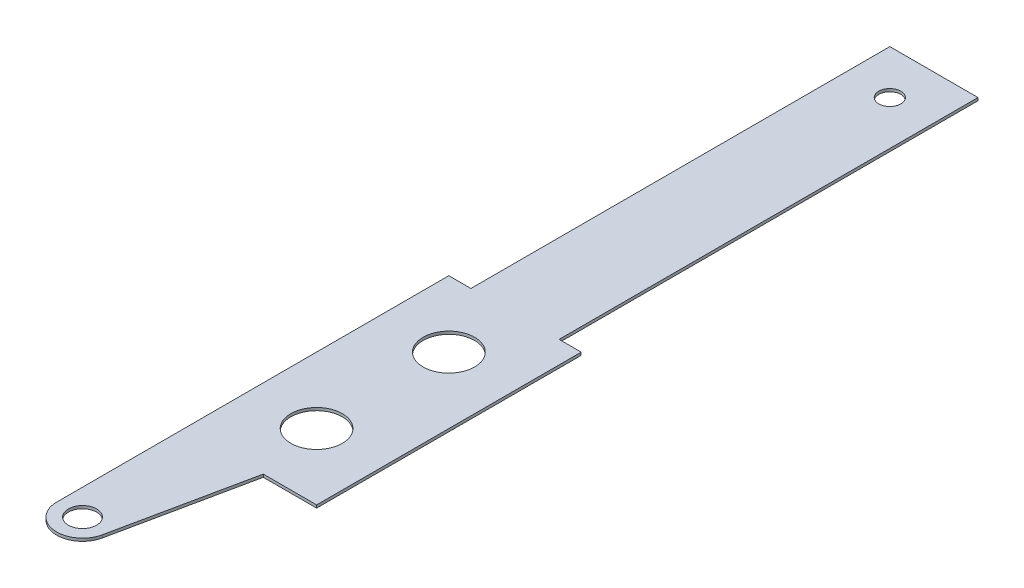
ISO-10303-21;
HEADER;
FILE_DESCRIPTION(('STEP AP214'),'2;1');
FILE_NAME('part.step','',(''),(''),'','','');
FILE_SCHEMA(('AUTOMOTIVE_DESIGN { 1 0 10303 214 1 1 1 1 }'));
ENDSEC;
DATA;
#1=APPLICATION_CONTEXT('core data for automotive mechanical design processes');
#2=APPLICATION_PROTOCOL_DEFINITION('international standard','automotive_design',2000,#1);
#3=PRODUCT_CONTEXT('',#1,'mechanical');
#4=PRODUCT('Part','Part','',(#3));
#5=PRODUCT_RELATED_PRODUCT_CATEGORY('part','',(#4));
#6=PRODUCT_DEFINITION_FORMATION('','',#4);
#7=PRODUCT_DEFINITION_CONTEXT('part definition',#1,'design');
#8=PRODUCT_DEFINITION('design','',#6,#7);
#9=PRODUCT_DEFINITION_SHAPE('','',#8);
#10=(LENGTH_UNIT() NAMED_UNIT(*) SI_UNIT(.MILLI.,.METRE.));
#11=(NAMED_UNIT(*) PLANE_ANGLE_UNIT() SI_UNIT($,.RADIAN.));
#12=(NAMED_UNIT(*) SI_UNIT($,.STERADIAN.) SOLID_ANGLE_UNIT());
#13=UNCERTAINTY_MEASURE_WITH_UNIT(LENGTH_MEASURE(1.E-05),#10,'distance_accuracy_value','');
#14=(GEOMETRIC_REPRESENTATION_CONTEXT(3) GLOBAL_UNCERTAINTY_ASSIGNED_CONTEXT((#13)) GLOBAL_UNIT_ASSIGNED_CONTEXT((#10,
#11,#12)) REPRESENTATION_CONTEXT('',''));
#15=CARTESIAN_POINT('',(0.,0.,0.));
#16=DIRECTION('',(0.,0.,1.));
#17=DIRECTION('',(1.,0.,0.));
#18=AXIS2_PLACEMENT_3D('',#15,#16,#17);
#19=CARTESIAN_POINT('',(-4.76631,-0.2032,9.525));
#20=DIRECTION('',(0.,0.,1.));
#21=DIRECTION('',(1.,0.,0.));
#22=AXIS2_PLACEMENT_3D('',#19,#20,#21);
#23=PLANE('',#22);
#24=DIRECTION('',(1.,0.,0.));
#25=VECTOR('',#24,1.);
#26=CARTESIAN_POINT('',(-4.76631,0.,9.525));
#27=LINE('',#26,#25);
#28=CARTESIAN_POINT('',(0.923290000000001,0.,9.525));
#29=VERTEX_POINT('',#28);
#30=CARTESIAN_POINT('',(4.76631,0.,9.525));
#31=VERTEX_POINT('',#30);
#32=EDGE_CURVE('E129',#29,#31,#27,.T.);
#33=ORIENTED_EDGE('',*,*,#32,.F.);
#34=DIRECTION('',(0.,-1.,0.));
#35=VECTOR('',#34,1.);
#36=CARTESIAN_POINT('',(0.923290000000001,0.,9.525));
#37=LINE('',#36,#35);
#38=CARTESIAN_POINT('',(0.923289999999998,-0.2032,9.525));
#39=VERTEX_POINT('',#38);
#40=EDGE_CURVE('E114',#29,#39,#37,.T.);
#41=ORIENTED_EDGE('',*,*,#40,.T.);
#42=DIRECTION('',(1.,0.,0.));
#43=VECTOR('',#42,1.);
#44=CARTESIAN_POINT('',(-4.76631,-0.2032,9.525));
#45=LINE('',#44,#43);
#46=CARTESIAN_POINT('',(4.76631,-0.2032,9.525));
#47=VERTEX_POINT('',#46);
#48=EDGE_CURVE('E147',#39,#47,#45,.T.);
#49=ORIENTED_EDGE('',*,*,#48,.T.);
#50=DIRECTION('',(0.,1.,0.));
#51=VECTOR('',#50,1.);
#52=CARTESIAN_POINT('',(4.76631,-0.2032,9.525));
#53=LINE('',#52,#51);
#54=EDGE_CURVE('E11',#47,#31,#53,.T.);
#55=ORIENTED_EDGE('',*,*,#54,.T.);
#56=EDGE_LOOP('',(#33,#41,#49,#55));
#57=FACE_BOUND('',#56,.T.);
#58=ADVANCED_FACE('F37',(#57),#23,.T.);
#59=CARTESIAN_POINT('',(-4.76631,-0.2032,-9.525));
#60=DIRECTION('',(0.,0.,-1.));
#61=DIRECTION('',(-1.,0.,0.));
#62=AXIS2_PLACEMENT_3D('',#59,#60,#61);
#63=PLANE('',#62);
#64=DIRECTION('',(-1.,0.,0.));
#65=VECTOR('',#64,1.);
#66=CARTESIAN_POINT('',(-4.76631,-0.2032,-9.525));
#67=LINE('',#66,#65);
#68=CARTESIAN_POINT('',(4.76631,-0.2032,-9.525));
#69=VERTEX_POINT('',#68);
#70=CARTESIAN_POINT('',(3.175,-0.2032,-9.525));
#71=VERTEX_POINT('',#70);
#72=EDGE_CURVE('E170',#69,#71,#67,.T.);
#73=ORIENTED_EDGE('',*,*,#72,.T.);
#74=DIRECTION('',(0.,1.,0.));
#75=VECTOR('',#74,1.);
#76=CARTESIAN_POINT('',(3.175,-0.2032,-9.525));
#77=LINE('',#76,#75);
#78=CARTESIAN_POINT('',(3.17499999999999,0.,-9.525));
#79=VERTEX_POINT('',#78);
#80=EDGE_CURVE('E232',#71,#79,#77,.T.);
#81=ORIENTED_EDGE('',*,*,#80,.T.);
#82=DIRECTION('',(-1.,0.,0.));
#83=VECTOR('',#82,1.);
#84=CARTESIAN_POINT('',(-4.76631,0.,-9.525));
#85=LINE('',#84,#83);
#86=CARTESIAN_POINT('',(4.76631,0.,-9.525));
#87=VERTEX_POINT('',#86);
#88=EDGE_CURVE('E140',#87,#79,#85,.T.);
#89=ORIENTED_EDGE('',*,*,#88,.F.);
#90=DIRECTION('',(0.,1.,0.));
#91=VECTOR('',#90,1.);
#92=CARTESIAN_POINT('',(4.76631,-0.2032,-9.525));
#93=LINE('',#92,#91);
#94=EDGE_CURVE('E155',#69,#87,#93,.T.);
#95=ORIENTED_EDGE('',*,*,#94,.F.);
#96=EDGE_LOOP('',(#73,#81,#89,#95));
#97=FACE_BOUND('',#96,.T.);
#98=ADVANCED_FACE('F285',(#97),#63,.T.);
#99=CARTESIAN_POINT('',(4.76631,-0.2032,9.525));
#100=DIRECTION('',(1.,0.,0.));
#101=DIRECTION('',(0.,0.,-1.));
#102=AXIS2_PLACEMENT_3D('',#99,#100,#101);
#103=PLANE('',#102);
#104=DIRECTION('',(0.,0.,-1.));
#105=VECTOR('',#104,1.);
#106=CARTESIAN_POINT('',(4.76631,0.,9.525));
#107=LINE('',#106,#105);
#108=EDGE_CURVE('E163',#31,#87,#107,.T.);
#109=ORIENTED_EDGE('',*,*,#108,.F.);
#110=ORIENTED_EDGE('',*,*,#54,.F.);
#111=DIRECTION('',(0.,0.,-1.));
#112=VECTOR('',#111,1.);
#113=CARTESIAN_POINT('',(4.76631,-0.2032,9.525));
#114=LINE('',#113,#112);
#115=EDGE_CURVE('E134',#47,#69,#114,.T.);
#116=ORIENTED_EDGE('',*,*,#115,.T.);
#117=ORIENTED_EDGE('',*,*,#94,.T.);
#118=EDGE_LOOP('',(#109,#110,#116,#117));
#119=FACE_BOUND('',#118,.T.);
#120=ADVANCED_FACE('F39',(#119),#103,.T.);
#121=CARTESIAN_POINT('',(-4.76631,-0.2032,9.525));
#122=DIRECTION('',(-1.,0.,0.));
#123=DIRECTION('',(0.,0.,1.));
#124=AXIS2_PLACEMENT_3D('',#121,#122,#123);
#125=PLANE('',#124);
#126=DIRECTION('',(0.,0.,1.));
#127=VECTOR('',#126,1.);
#128=CARTESIAN_POINT('',(-4.76631,0.,9.525));
#129=LINE('',#128,#127);
#130=CARTESIAN_POINT('',(-4.76631,0.,-9.525));
#131=VERTEX_POINT('',#130);
#132=CARTESIAN_POINT('',(-4.76631,0.,18.7126917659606));
#133=VERTEX_POINT('',#132);
#134=EDGE_CURVE('E135',#131,#133,#129,.T.);
#135=ORIENTED_EDGE('',*,*,#134,.F.);
#136=DIRECTION('',(0.,1.,0.));
#137=VECTOR('',#136,1.);
#138=CARTESIAN_POINT('',(-4.76631,-0.2032,-9.525));
#139=LINE('',#138,#137);
#140=CARTESIAN_POINT('',(-4.76631,-0.2032,-9.525));
#141=VERTEX_POINT('',#140);
#142=EDGE_CURVE('E46',#141,#131,#139,.T.);
#143=ORIENTED_EDGE('',*,*,#142,.F.);
#144=DIRECTION('',(0.,0.,1.));
#145=VECTOR('',#144,1.);
#146=CARTESIAN_POINT('',(-4.76631,-0.2032,9.525));
#147=LINE('',#146,#145);
#148=CARTESIAN_POINT('',(-4.76631,-0.2032,18.7126917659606));
#149=VERTEX_POINT('',#148);
#150=EDGE_CURVE('E168',#141,#149,#147,.T.);
#151=ORIENTED_EDGE('',*,*,#150,.T.);
#152=DIRECTION('',(0.,-1.,0.));
#153=VECTOR('',#152,1.);
#154=CARTESIAN_POINT('',(-4.76631,0.,18.7126917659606));
#155=LINE('',#154,#153);
#156=EDGE_CURVE('E205',#133,#149,#155,.T.);
#157=ORIENTED_EDGE('',*,*,#156,.F.);
#158=EDGE_LOOP('',(#135,#143,#151,#157));
#159=FACE_BOUND('',#158,.T.);
#160=ADVANCED_FACE('F191',(#159),#125,.T.);
#161=DIRECTION('',(0.,1.,0.));
#162=VECTOR('',#161,1.);
#163=CARTESIAN_POINT('',(-3.175,-0.2032,-9.525));
#164=LINE('',#163,#162);
#165=CARTESIAN_POINT('',(-3.175,-0.2032,-9.525));
#166=VERTEX_POINT('',#165);
#167=CARTESIAN_POINT('',(-3.175,0.,-9.525));
#168=VERTEX_POINT('',#167);
#169=EDGE_CURVE('E186',#166,#168,#164,.T.);
#170=ORIENTED_EDGE('',*,*,#169,.F.);
#171=EDGE_CURVE('E138',#166,#141,#67,.T.);
#172=ORIENTED_EDGE('',*,*,#171,.T.);
#173=ORIENTED_EDGE('',*,*,#142,.T.);
#174=EDGE_CURVE('E159',#168,#131,#85,.T.);
#175=ORIENTED_EDGE('',*,*,#174,.F.);
#176=EDGE_LOOP('',(#170,#172,#173,#175));
#177=FACE_BOUND('',#176,.T.);
#178=ADVANCED_FACE('F183',(#177),#63,.T.);
#179=CARTESIAN_POINT('',(0.,-0.2032,0.));
#180=DIRECTION('',(0.,-1.,0.));
#181=DIRECTION('',(0.,0.,-1.));
#182=AXIS2_PLACEMENT_3D('',#179,#180,#181);
#183=PLANE('',#182);
#184=CARTESIAN_POINT('',(0.,-0.2032,-36.5125));
#185=DIRECTION('',(0.,1.,0.));
#186=DIRECTION('',(0.,0.,1.));
#187=AXIS2_PLACEMENT_3D('',#184,#185,#186);
#188=CIRCLE('',#187,0.79375);
#189=CARTESIAN_POINT('',(0.,-0.2032,-35.71875));
#190=VERTEX_POINT('',#189);
#191=EDGE_CURVE('E211',#190,#190,#188,.T.);
#192=ORIENTED_EDGE('',*,*,#191,.T.);
#193=EDGE_LOOP('',(#192));
#194=FACE_BOUND('',#193,.T.);
#195=CARTESIAN_POINT('',(0.,-0.2032,4.7625));
#196=DIRECTION('',(0.,1.,0.));
#197=DIRECTION('',(0.,0.,-1.));
#198=AXIS2_PLACEMENT_3D('',#195,#196,#197);
#199=CIRCLE('',#198,1.8542);
#200=CARTESIAN_POINT('',(0.,-0.2032,2.9083));
#201=VERTEX_POINT('',#200);
#202=EDGE_CURVE('E257',#201,#201,#199,.T.);
#203=ORIENTED_EDGE('',*,*,#202,.T.);
#204=EDGE_LOOP('',(#203));
#205=FACE_BOUND('',#204,.T.);
#206=CARTESIAN_POINT('',(0.,-0.2032,-4.7625));
#207=DIRECTION('',(0.,1.,0.));
#208=DIRECTION('',(0.,0.,1.));
#209=AXIS2_PLACEMENT_3D('',#206,#207,#208);
#210=CIRCLE('',#209,1.8542);
#211=CARTESIAN_POINT('',(0.,-0.2032,-2.9083));
#212=VERTEX_POINT('',#211);
#213=EDGE_CURVE('E165',#212,#212,#210,.T.);
#214=ORIENTED_EDGE('',*,*,#213,.T.);
#215=EDGE_LOOP('',(#214));
#216=FACE_BOUND('',#215,.T.);
#217=ORIENTED_EDGE('',*,*,#115,.F.);
#218=ORIENTED_EDGE('',*,*,#48,.F.);
#219=DIRECTION('',(-0.205220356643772,0.,0.978715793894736));
#220=VECTOR('',#219,1.);
#221=CARTESIAN_POINT('',(0.923290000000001,-0.2032,9.525));
#222=LINE('',#221,#220);
#223=CARTESIAN_POINT('',(-1.08331,-0.2032,19.0946701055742));
#224=VERTEX_POINT('',#223);
#225=EDGE_CURVE('E54',#39,#224,#222,.T.);
#226=ORIENTED_EDGE('',*,*,#225,.T.);
#227=CARTESIAN_POINT('',(-2.90500176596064,-0.2032,18.7126917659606));
#228=DIRECTION('',(0.,-1.,0.));
#229=DIRECTION('',(0.,0.,1.));
#230=AXIS2_PLACEMENT_3D('',#227,#228,#229);
#231=CIRCLE('',#230,1.86130823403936);
#232=EDGE_CURVE('E131',#224,#149,#231,.T.);
#233=ORIENTED_EDGE('',*,*,#232,.T.);
#234=ORIENTED_EDGE('',*,*,#150,.F.);
#235=ORIENTED_EDGE('',*,*,#171,.F.);
#236=DIRECTION('',(0.,0.,1.));
#237=VECTOR('',#236,1.);
#238=CARTESIAN_POINT('',(-3.175,-0.2032,-39.6875));
#239=LINE('',#238,#237);
#240=CARTESIAN_POINT('',(-3.175,-0.2032,-39.6875));
#241=VERTEX_POINT('',#240);
#242=EDGE_CURVE('E221',#241,#166,#239,.T.);
#243=ORIENTED_EDGE('',*,*,#242,.F.);
#244=DIRECTION('',(-1.,0.,0.));
#245=VECTOR('',#244,1.);
#246=CARTESIAN_POINT('',(-3.175,-0.2032,-39.6875));
#247=LINE('',#246,#245);
#248=CARTESIAN_POINT('',(3.175,-0.2032,-39.6875));
#249=VERTEX_POINT('',#248);
#250=EDGE_CURVE('E218',#249,#241,#247,.T.);
#251=ORIENTED_EDGE('',*,*,#250,.F.);
#252=DIRECTION('',(0.,0.,-1.));
#253=VECTOR('',#252,1.);
#254=CARTESIAN_POINT('',(3.175,-0.2032,-39.6875));
#255=LINE('',#254,#253);
#256=EDGE_CURVE('E222',#71,#249,#255,.T.);
#257=ORIENTED_EDGE('',*,*,#256,.F.);
#258=ORIENTED_EDGE('',*,*,#72,.F.);
#259=EDGE_LOOP('',(#217,#218,#226,#233,#234,#235,#243,#251,#257,#258));
#260=FACE_BOUND('',#259,.T.);
#261=CARTESIAN_POINT('',(-2.90500176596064,-0.2032,18.7126917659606));
#262=DIRECTION('',(0.,-1.,0.));
#263=DIRECTION('',(0.,0.,-1.));
#264=AXIS2_PLACEMENT_3D('',#261,#262,#263);
#265=CIRCLE('',#264,1.016);
#266=CARTESIAN_POINT('',(-2.90500176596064,-0.2032,17.6966917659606));
#267=VERTEX_POINT('',#266);
#268=EDGE_CURVE('E458',#267,#267,#265,.T.);
#269=ORIENTED_EDGE('',*,*,#268,.F.);
#270=EDGE_LOOP('',(#269));
#271=FACE_BOUND('',#270,.T.);
#272=ADVANCED_FACE('F196',(#194,#205,#216,#260,#271),#183,.T.);
#273=CARTESIAN_POINT('',(0.,0.,0.));
#274=DIRECTION('',(0.,-1.,0.));
#275=DIRECTION('',(0.,0.,-1.));
#276=AXIS2_PLACEMENT_3D('',#273,#274,#275);
#277=PLANE('',#276);
#278=CARTESIAN_POINT('',(0.,0.,-36.5125));
#279=DIRECTION('',(0.,1.,0.));
#280=DIRECTION('',(0.,0.,1.));
#281=AXIS2_PLACEMENT_3D('',#278,#279,#280);
#282=CIRCLE('',#281,0.79375);
#283=CARTESIAN_POINT('',(0.,0.,-35.71875));
#284=VERTEX_POINT('',#283);
#285=EDGE_CURVE('E207',#284,#284,#282,.T.);
#286=ORIENTED_EDGE('',*,*,#285,.F.);
#287=EDGE_LOOP('',(#286));
#288=FACE_BOUND('',#287,.T.);
#289=CARTESIAN_POINT('',(0.,0.,4.7625));
#290=DIRECTION('',(0.,1.,0.));
#291=DIRECTION('',(0.,0.,-1.));
#292=AXIS2_PLACEMENT_3D('',#289,#290,#291);
#293=CIRCLE('',#292,1.8542);
#294=CARTESIAN_POINT('',(0.,0.,2.9083));
#295=VERTEX_POINT('',#294);
#296=EDGE_CURVE('E235',#295,#295,#293,.T.);
#297=ORIENTED_EDGE('',*,*,#296,.F.);
#298=EDGE_LOOP('',(#297));
#299=FACE_BOUND('',#298,.T.);
#300=CARTESIAN_POINT('',(0.,0.,-4.7625));
#301=DIRECTION('',(0.,1.,0.));
#302=DIRECTION('',(0.,0.,1.));
#303=AXIS2_PLACEMENT_3D('',#300,#301,#302);
#304=CIRCLE('',#303,1.8542);
#305=CARTESIAN_POINT('',(0.,0.,-2.9083));
#306=VERTEX_POINT('',#305);
#307=EDGE_CURVE('E260',#306,#306,#304,.T.);
#308=ORIENTED_EDGE('',*,*,#307,.F.);
#309=EDGE_LOOP('',(#308));
#310=FACE_BOUND('',#309,.T.);
#311=ORIENTED_EDGE('',*,*,#108,.T.);
#312=ORIENTED_EDGE('',*,*,#88,.T.);
#313=DIRECTION('',(0.,0.,-1.));
#314=VECTOR('',#313,1.);
#315=CARTESIAN_POINT('',(3.175,0.,-39.6875));
#316=LINE('',#315,#314);
#317=CARTESIAN_POINT('',(3.175,0.,-39.6875));
#318=VERTEX_POINT('',#317);
#319=EDGE_CURVE('E62',#79,#318,#316,.T.);
#320=ORIENTED_EDGE('',*,*,#319,.T.);
#321=DIRECTION('',(-1.,0.,0.));
#322=VECTOR('',#321,1.);
#323=CARTESIAN_POINT('',(-3.175,0.,-39.6875));
#324=LINE('',#323,#322);
#325=CARTESIAN_POINT('',(-3.175,0.,-39.6875));
#326=VERTEX_POINT('',#325);
#327=EDGE_CURVE('E223',#318,#326,#324,.T.);
#328=ORIENTED_EDGE('',*,*,#327,.T.);
#329=DIRECTION('',(0.,0.,1.));
#330=VECTOR('',#329,1.);
#331=CARTESIAN_POINT('',(-3.175,0.,-39.6875));
#332=LINE('',#331,#330);
#333=EDGE_CURVE('E226',#326,#168,#332,.T.);
#334=ORIENTED_EDGE('',*,*,#333,.T.);
#335=ORIENTED_EDGE('',*,*,#174,.T.);
#336=ORIENTED_EDGE('',*,*,#134,.T.);
#337=CARTESIAN_POINT('',(-2.90500176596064,0.,18.7126917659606));
#338=DIRECTION('',(0.,-1.,0.));
#339=DIRECTION('',(0.,0.,1.));
#340=AXIS2_PLACEMENT_3D('',#337,#338,#339);
#341=CIRCLE('',#340,1.86130823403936);
#342=CARTESIAN_POINT('',(-1.08331,0.,19.0946701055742));
#343=VERTEX_POINT('',#342);
#344=EDGE_CURVE('E122',#343,#133,#341,.T.);
#345=ORIENTED_EDGE('',*,*,#344,.F.);
#346=DIRECTION('',(-0.205220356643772,0.,0.978715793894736));
#347=VECTOR('',#346,1.);
#348=CARTESIAN_POINT('',(0.923290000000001,0.,9.525));
#349=LINE('',#348,#347);
#350=EDGE_CURVE('E117',#29,#343,#349,.T.);
#351=ORIENTED_EDGE('',*,*,#350,.F.);
#352=ORIENTED_EDGE('',*,*,#32,.T.);
#353=EDGE_LOOP('',(#311,#312,#320,#328,#334,#335,#336,#345,#351,#352));
#354=FACE_BOUND('',#353,.T.);
#355=CARTESIAN_POINT('',(-2.90500176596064,0.,18.7126917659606));
#356=DIRECTION('',(0.,-1.,0.));
#357=DIRECTION('',(0.,0.,-1.));
#358=AXIS2_PLACEMENT_3D('',#355,#356,#357);
#359=CIRCLE('',#358,1.016);
#360=CARTESIAN_POINT('',(-2.90500176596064,0.,17.6966917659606));
#361=VERTEX_POINT('',#360);
#362=EDGE_CURVE('E201',#361,#361,#359,.T.);
#363=ORIENTED_EDGE('',*,*,#362,.T.);
#364=EDGE_LOOP('',(#363));
#365=FACE_BOUND('',#364,.T.);
#366=ADVANCED_FACE('F127',(#288,#299,#310,#354,#365),#277,.F.);
#367=CARTESIAN_POINT('',(0.,-0.2032,-4.7625));
#368=DIRECTION('',(0.,1.,0.));
#369=DIRECTION('',(0.,0.,1.));
#370=AXIS2_PLACEMENT_3D('',#367,#368,#369);
#371=CYLINDRICAL_SURFACE('',#370,1.8542);
#372=ORIENTED_EDGE('',*,*,#213,.F.);
#373=EDGE_LOOP('',(#372));
#374=FACE_BOUND('',#373,.T.);
#375=ORIENTED_EDGE('',*,*,#307,.T.);
#376=EDGE_LOOP('',(#375));
#377=FACE_BOUND('',#376,.T.);
#378=ADVANCED_FACE('F267',(#374,#377),#371,.F.);
#379=CARTESIAN_POINT('',(0.,-0.2032,4.7625));
#380=DIRECTION('',(0.,1.,0.));
#381=DIRECTION('',(0.,0.,1.));
#382=AXIS2_PLACEMENT_3D('',#379,#380,#381);
#383=CYLINDRICAL_SURFACE('',#382,1.8542);
#384=ORIENTED_EDGE('',*,*,#202,.F.);
#385=EDGE_LOOP('',(#384));
#386=FACE_BOUND('',#385,.T.);
#387=ORIENTED_EDGE('',*,*,#296,.T.);
#388=EDGE_LOOP('',(#387));
#389=FACE_BOUND('',#388,.T.);
#390=ADVANCED_FACE('F276',(#386,#389),#383,.F.);
#391=CARTESIAN_POINT('',(3.175,-0.2032,-39.6875));
#392=DIRECTION('',(1.,0.,0.));
#393=DIRECTION('',(0.,0.,-1.));
#394=AXIS2_PLACEMENT_3D('',#391,#392,#393);
#395=PLANE('',#394);
#396=ORIENTED_EDGE('',*,*,#319,.F.);
#397=ORIENTED_EDGE('',*,*,#80,.F.);
#398=ORIENTED_EDGE('',*,*,#256,.T.);
#399=DIRECTION('',(0.,1.,0.));
#400=VECTOR('',#399,1.);
#401=CARTESIAN_POINT('',(3.175,-0.2032,-39.6875));
#402=LINE('',#401,#400);
#403=EDGE_CURVE('E244',#249,#318,#402,.T.);
#404=ORIENTED_EDGE('',*,*,#403,.T.);
#405=EDGE_LOOP('',(#396,#397,#398,#404));
#406=FACE_BOUND('',#405,.T.);
#407=ADVANCED_FACE('F351',(#406),#395,.T.);
#408=CARTESIAN_POINT('',(-3.175,-0.2032,-39.6875));
#409=DIRECTION('',(-1.,0.,0.));
#410=DIRECTION('',(0.,0.,1.));
#411=AXIS2_PLACEMENT_3D('',#408,#409,#410);
#412=PLANE('',#411);
#413=ORIENTED_EDGE('',*,*,#333,.F.);
#414=DIRECTION('',(0.,1.,0.));
#415=VECTOR('',#414,1.);
#416=CARTESIAN_POINT('',(-3.175,-0.2032,-39.6875));
#417=LINE('',#416,#415);
#418=EDGE_CURVE('E242',#241,#326,#417,.T.);
#419=ORIENTED_EDGE('',*,*,#418,.F.);
#420=ORIENTED_EDGE('',*,*,#242,.T.);
#421=ORIENTED_EDGE('',*,*,#169,.T.);
#422=EDGE_LOOP('',(#413,#419,#420,#421));
#423=FACE_BOUND('',#422,.T.);
#424=ADVANCED_FACE('F250',(#423),#412,.T.);
#425=CARTESIAN_POINT('',(-3.175,-0.2032,-39.6875));
#426=DIRECTION('',(0.,0.,-1.));
#427=DIRECTION('',(-1.,0.,0.));
#428=AXIS2_PLACEMENT_3D('',#425,#426,#427);
#429=PLANE('',#428);
#430=ORIENTED_EDGE('',*,*,#327,.F.);
#431=ORIENTED_EDGE('',*,*,#403,.F.);
#432=ORIENTED_EDGE('',*,*,#250,.T.);
#433=ORIENTED_EDGE('',*,*,#418,.T.);
#434=EDGE_LOOP('',(#430,#431,#432,#433));
#435=FACE_BOUND('',#434,.T.);
#436=ADVANCED_FACE('F254',(#435),#429,.T.);
#437=CARTESIAN_POINT('',(0.,-0.2032,-36.5125));
#438=DIRECTION('',(0.,1.,0.));
#439=DIRECTION('',(0.,0.,1.));
#440=AXIS2_PLACEMENT_3D('',#437,#438,#439);
#441=CYLINDRICAL_SURFACE('',#440,0.79375);
#442=ORIENTED_EDGE('',*,*,#191,.F.);
#443=EDGE_LOOP('',(#442));
#444=FACE_BOUND('',#443,.T.);
#445=ORIENTED_EDGE('',*,*,#285,.T.);
#446=EDGE_LOOP('',(#445));
#447=FACE_BOUND('',#446,.T.);
#448=ADVANCED_FACE('F321',(#444,#447),#441,.F.);
#449=CARTESIAN_POINT('',(-2.90500176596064,0.,18.7126917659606));
#450=DIRECTION('',(0.,-1.,0.));
#451=DIRECTION('',(0.,0.,-1.));
#452=AXIS2_PLACEMENT_3D('',#449,#450,#451);
#453=CYLINDRICAL_SURFACE('',#452,1.86130823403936);
#454=ORIENTED_EDGE('',*,*,#232,.F.);
#455=DIRECTION('',(0.,-1.,0.));
#456=VECTOR('',#455,1.);
#457=CARTESIAN_POINT('',(-1.08331,0.,19.0946701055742));
#458=LINE('',#457,#456);
#459=EDGE_CURVE('E121',#343,#224,#458,.T.);
#460=ORIENTED_EDGE('',*,*,#459,.F.);
#461=ORIENTED_EDGE('',*,*,#344,.T.);
#462=ORIENTED_EDGE('',*,*,#156,.T.);
#463=EDGE_LOOP('',(#454,#460,#461,#462));
#464=FACE_BOUND('',#463,.T.);
#465=ADVANCED_FACE('F317',(#464),#453,.T.);
#466=CARTESIAN_POINT('',(0.923290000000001,0.,9.525));
#467=DIRECTION('',(0.978715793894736,0.,0.205220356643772));
#468=DIRECTION('',(0.205220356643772,0.,-0.978715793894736));
#469=AXIS2_PLACEMENT_3D('',#466,#467,#468);
#470=PLANE('',#469);
#471=ORIENTED_EDGE('',*,*,#225,.F.);
#472=ORIENTED_EDGE('',*,*,#40,.F.);
#473=ORIENTED_EDGE('',*,*,#350,.T.);
#474=ORIENTED_EDGE('',*,*,#459,.T.);
#475=EDGE_LOOP('',(#471,#472,#473,#474));
#476=FACE_BOUND('',#475,.T.);
#477=ADVANCED_FACE('F116',(#476),#470,.T.);
#478=CARTESIAN_POINT('',(-2.90500176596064,0.,18.7126917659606));
#479=DIRECTION('',(0.,-1.,0.));
#480=DIRECTION('',(0.,0.,-1.));
#481=AXIS2_PLACEMENT_3D('',#478,#479,#480);
#482=CYLINDRICAL_SURFACE('',#481,1.016);
#483=ORIENTED_EDGE('',*,*,#362,.F.);
#484=EDGE_LOOP('',(#483));
#485=FACE_BOUND('',#484,.T.);
#486=ORIENTED_EDGE('',*,*,#268,.T.);
#487=EDGE_LOOP('',(#486));
#488=FACE_BOUND('',#487,.T.);
#489=ADVANCED_FACE('F331',(#485,#488),#482,.F.);
#490=CLOSED_SHELL('',(#58,#98,#120,#160,#178,#272,#366,#378,#390,#407,#424,#436,#448,#465,#477,#489));
#491=MANIFOLD_SOLID_BREP('B2',#490);
#492=ADVANCED_BREP_SHAPE_REPRESENTATION('',(#18,#491),#14);
#493=SHAPE_DEFINITION_REPRESENTATION(#9,#492);
ENDSEC;
END-ISO-10303-21;
